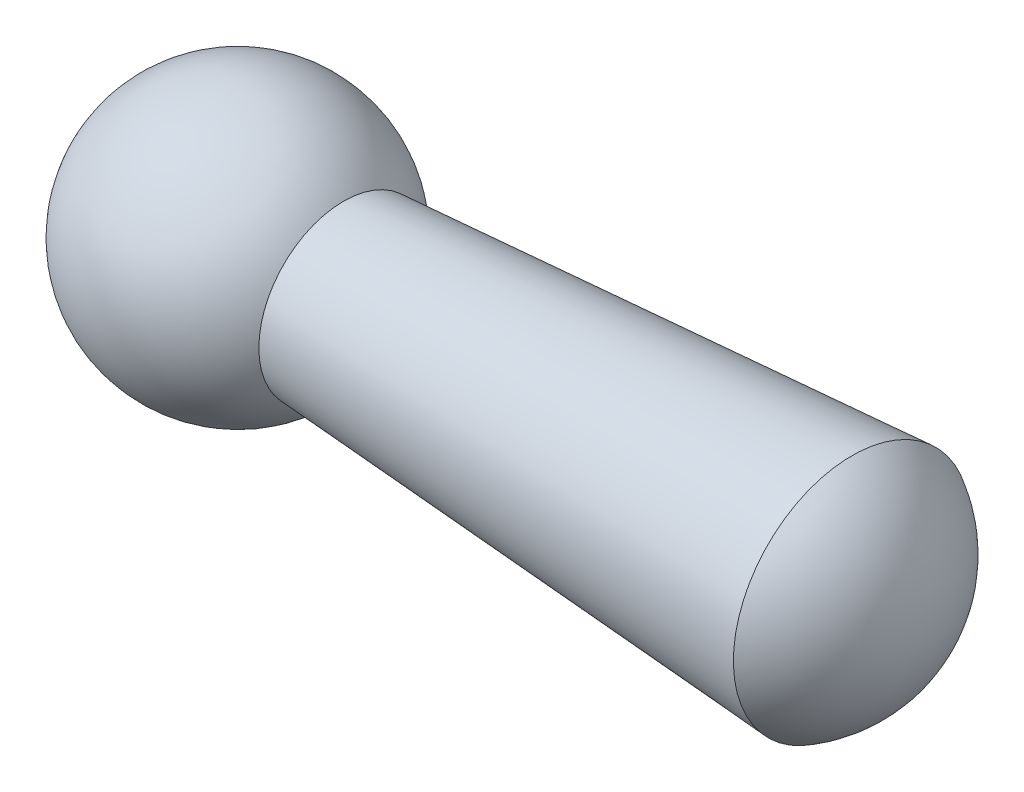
from build123d import *


with BuildPart() as part:
    # Esquisse1 → R_volution1 (revolve)
    with BuildSketch(Plane.XY, mode=Mode.PRIVATE) as r_volution1_sk:
        with BuildLine():
            Line((3.122498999, 2.5), (18.122498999, 3.5))
            ThreePointArc((18.122498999, 3.5), (19.631726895, 2.031506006), (20.186007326, 0))
            Line((20.186007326, 0), (-4, 0))
            ThreePointArc((-4, 0), (-1.324764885, 3.774254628), (3.122498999, 2.5))
        make_face()
    revolve(r_volution1_sk.sketch.rotate(Axis((-4, 0, 0), (1, 0, 0)), 180), axis=Axis((-4, 0, 0), (1, 0, 0)))


solid = part.part
